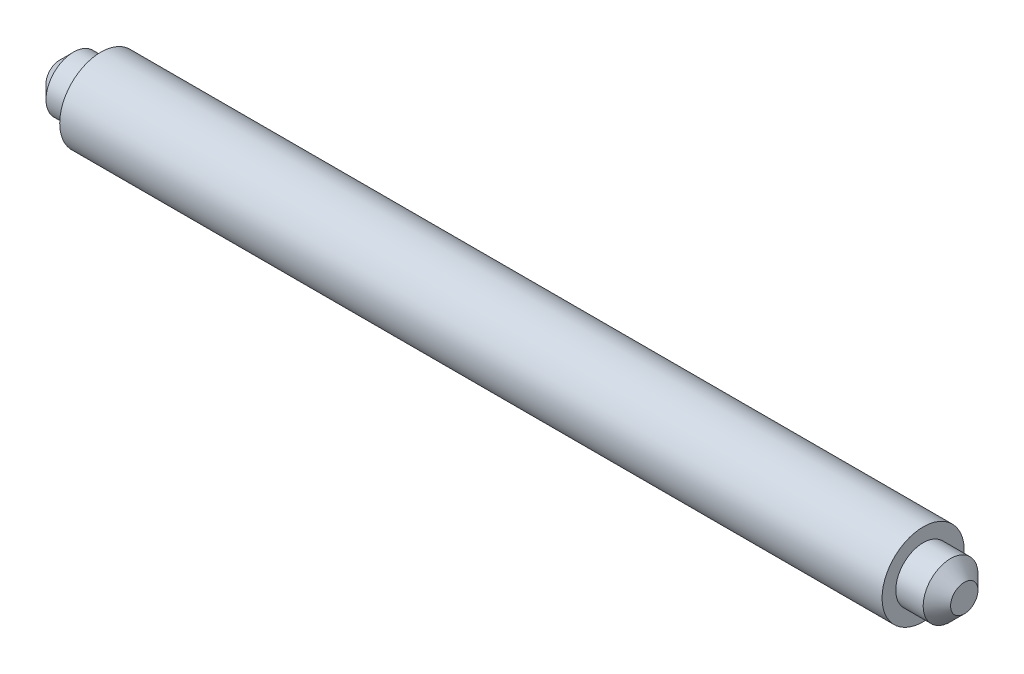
from build123d import *

# Parameters (mm, degrees)
CHANFREIN1_SIZE = 1


with BuildPart() as part:
    # Esquisse1 → Base-R_volution (revolve)
    with BuildSketch(Plane.XY, mode=Mode.PRIVATE) as base_r_volution_sk:
        Polygon((-33, 2), (-33, 0), (33, 0), (33, 2), (30, 2), (30, 3), (-30, 3), (-30, 2), align=None)
    revolve(base_r_volution_sk.sketch.rotate(Axis((-77, 0, 0), (1, 0, 0)), 90), axis=Axis((-77, 0, 0), (1, 0, 0)))

    # Chanfrein1
    chanfrein1_edges = [part.edges().sort_by_distance(p)[0] for p in [
        (-33, 0, -2),
        (33, 0, -2),
    ]]
    chamfer(chanfrein1_edges, length=CHANFREIN1_SIZE)


solid = part.part
